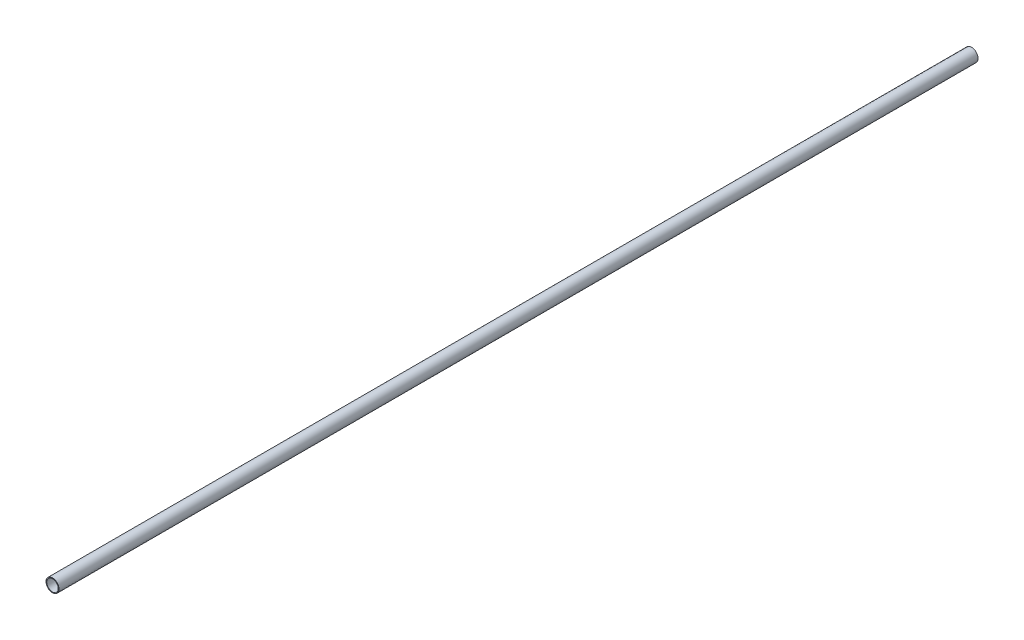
from build123d import *

# Parameters (mm, degrees)
ESQUISSE1_R        = 14.04315261
ESQUISSE1_R_2      = 12.5
EXTRU_MINCE1_DEPTH = 1990


with BuildPart() as part:
    # Esquisse1 → Extru.-Mince1 (new body)
    with BuildSketch(Plane.XY):
        Circle(ESQUISSE1_R)
        Circle(ESQUISSE1_R_2, mode=Mode.SUBTRACT)
    extrude(amount=EXTRU_MINCE1_DEPTH)


solid = part.part
